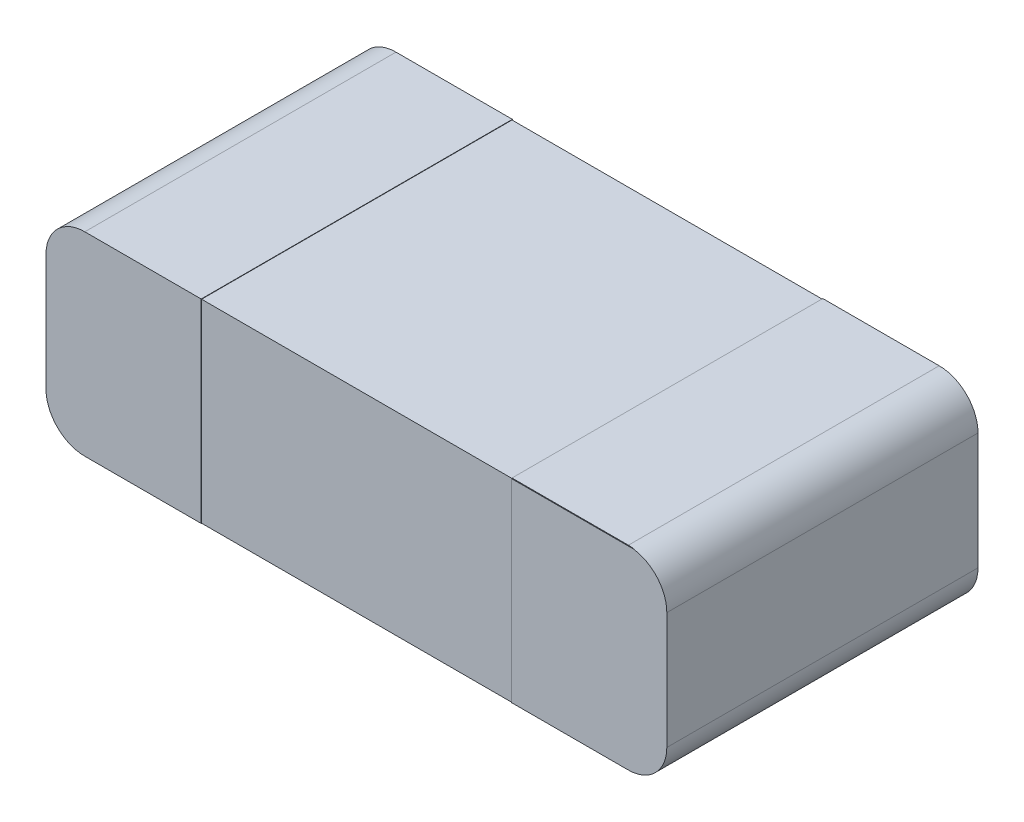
ISO-10303-21;
HEADER;
FILE_DESCRIPTION(('STEP AP214'),'2;1');
FILE_NAME('part.step','',(''),(''),'','','');
FILE_SCHEMA(('AUTOMOTIVE_DESIGN { 1 0 10303 214 1 1 1 1 }'));
ENDSEC;
DATA;
#1=APPLICATION_CONTEXT('core data for automotive mechanical design processes');
#2=APPLICATION_PROTOCOL_DEFINITION('international standard','automotive_design',2000,#1);
#3=PRODUCT_CONTEXT('',#1,'mechanical');
#4=PRODUCT('Part','Part','',(#3));
#5=PRODUCT_RELATED_PRODUCT_CATEGORY('part','',(#4));
#6=PRODUCT_DEFINITION_FORMATION('','',#4);
#7=PRODUCT_DEFINITION_CONTEXT('part definition',#1,'design');
#8=PRODUCT_DEFINITION('design','',#6,#7);
#9=PRODUCT_DEFINITION_SHAPE('','',#8);
#10=(LENGTH_UNIT() NAMED_UNIT(*) SI_UNIT(.MILLI.,.METRE.));
#11=(NAMED_UNIT(*) PLANE_ANGLE_UNIT() SI_UNIT($,.RADIAN.));
#12=(NAMED_UNIT(*) SI_UNIT($,.STERADIAN.) SOLID_ANGLE_UNIT());
#13=UNCERTAINTY_MEASURE_WITH_UNIT(LENGTH_MEASURE(1.E-05),#10,'distance_accuracy_value','');
#14=(GEOMETRIC_REPRESENTATION_CONTEXT(3) GLOBAL_UNCERTAINTY_ASSIGNED_CONTEXT((#13)) GLOBAL_UNIT_ASSIGNED_CONTEXT((#10,
#11,#12)) REPRESENTATION_CONTEXT('',''));
#15=CARTESIAN_POINT('',(0.,0.,0.));
#16=DIRECTION('',(0.,0.,1.));
#17=DIRECTION('',(1.,0.,0.));
#18=AXIS2_PLACEMENT_3D('',#15,#16,#17);
#19=CARTESIAN_POINT('',(0.800000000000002,0.5,0.400999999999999));
#20=DIRECTION('',(0.,-1.,0.));
#21=DIRECTION('',(0.,0.,-1.));
#22=AXIS2_PLACEMENT_3D('',#19,#20,#21);
#23=PLANE('',#22);
#24=DIRECTION('',(0.,0.,-1.));
#25=VECTOR('',#24,1.);
#26=CARTESIAN_POINT('',(0.714106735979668,0.5,0.));
#27=LINE('',#26,#25);
#28=CARTESIAN_POINT('',(0.714106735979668,0.5,0.399999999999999));
#29=VERTEX_POINT('',#28);
#30=CARTESIAN_POINT('',(0.714106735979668,0.5,0.400999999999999));
#31=VERTEX_POINT('',#30);
#32=EDGE_CURVE('E22',#29,#31,#27,.F.);
#33=ORIENTED_EDGE('',*,*,#32,.F.);
#34=DIRECTION('',(-1.,0.,0.));
#35=VECTOR('',#34,1.);
#36=CARTESIAN_POINT('',(-0.799999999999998,0.5,0.399999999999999));
#37=LINE('',#36,#35);
#38=CARTESIAN_POINT('',(0.400000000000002,0.5,0.399999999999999));
#39=VERTEX_POINT('',#38);
#40=EDGE_CURVE('E111',#29,#39,#37,.T.);
#41=ORIENTED_EDGE('',*,*,#40,.T.);
#42=DIRECTION('',(0.,0.,-1.));
#43=VECTOR('',#42,1.);
#44=CARTESIAN_POINT('',(0.400000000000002,0.5,0.400999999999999));
#45=LINE('',#44,#43);
#46=CARTESIAN_POINT('',(0.400000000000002,0.5,0.400999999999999));
#47=VERTEX_POINT('',#46);
#48=EDGE_CURVE('E135',#39,#47,#45,.F.);
#49=ORIENTED_EDGE('',*,*,#48,.T.);
#50=DIRECTION('',(1.,0.,0.));
#51=VECTOR('',#50,1.);
#52=CARTESIAN_POINT('',(0.,0.5,0.400999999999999));
#53=LINE('',#52,#51);
#54=EDGE_CURVE('E113',#31,#47,#53,.F.);
#55=ORIENTED_EDGE('',*,*,#54,.F.);
#56=EDGE_LOOP('',(#33,#41,#49,#55));
#57=FACE_BOUND('',#56,.T.);
#58=ADVANCED_FACE('F19',(#57),#23,.F.);
#59=CARTESIAN_POINT('',(0.700000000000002,0.401,0.));
#60=DIRECTION('',(0.,0.,-1.));
#61=DIRECTION('',(-1.,0.,0.));
#62=AXIS2_PLACEMENT_3D('',#59,#60,#61);
#63=CYLINDRICAL_SURFACE('',#62,0.1);
#64=CARTESIAN_POINT('',(0.700000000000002,0.401,0.399999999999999));
#65=DIRECTION('',(0.,0.,-1.));
#66=DIRECTION('',(-1.,0.,0.));
#67=AXIS2_PLACEMENT_3D('',#64,#65,#66);
#68=CIRCLE('',#67,0.1);
#69=CARTESIAN_POINT('',(0.700000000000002,0.501,0.399999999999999));
#70=VERTEX_POINT('',#69);
#71=EDGE_CURVE('E122',#70,#29,#68,.T.);
#72=ORIENTED_EDGE('',*,*,#71,.T.);
#73=ORIENTED_EDGE('',*,*,#32,.T.);
#74=CARTESIAN_POINT('',(0.700000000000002,0.401,0.400999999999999));
#75=DIRECTION('',(0.,0.,-1.));
#76=DIRECTION('',(-1.,0.,0.));
#77=AXIS2_PLACEMENT_3D('',#74,#75,#76);
#78=CIRCLE('',#77,0.1);
#79=CARTESIAN_POINT('',(0.800000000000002,0.401,0.400999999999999));
#80=VERTEX_POINT('',#79);
#81=EDGE_CURVE('E139',#80,#31,#78,.F.);
#82=ORIENTED_EDGE('',*,*,#81,.F.);
#83=DIRECTION('',(0.,0.,1.));
#84=VECTOR('',#83,1.);
#85=CARTESIAN_POINT('',(0.800000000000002,0.401,-0.400000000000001));
#86=LINE('',#85,#84);
#87=CARTESIAN_POINT('',(0.800000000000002,0.401,-0.401000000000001));
#88=VERTEX_POINT('',#87);
#89=EDGE_CURVE('E118',#80,#88,#86,.F.);
#90=ORIENTED_EDGE('',*,*,#89,.T.);
#91=CARTESIAN_POINT('',(0.700000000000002,0.401,-0.401000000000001));
#92=DIRECTION('',(0.,0.,-1.));
#93=DIRECTION('',(-1.,0.,0.));
#94=AXIS2_PLACEMENT_3D('',#91,#92,#93);
#95=CIRCLE('',#94,0.1);
#96=CARTESIAN_POINT('',(0.700000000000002,0.501,-0.401000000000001));
#97=VERTEX_POINT('',#96);
#98=EDGE_CURVE('E146',#88,#97,#95,.F.);
#99=ORIENTED_EDGE('',*,*,#98,.T.);
#100=DIRECTION('',(0.,0.,-1.));
#101=VECTOR('',#100,1.);
#102=CARTESIAN_POINT('',(0.700000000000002,0.501,0.));
#103=LINE('',#102,#101);
#104=EDGE_CURVE('E131',#97,#70,#103,.F.);
#105=ORIENTED_EDGE('',*,*,#104,.T.);
#106=EDGE_LOOP('',(#72,#73,#82,#90,#99,#105));
#107=FACE_BOUND('',#106,.T.);
#108=ADVANCED_FACE('F129',(#107),#63,.T.);
#109=CARTESIAN_POINT('',(0.800000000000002,0.5,-0.400000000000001));
#110=DIRECTION('',(-1.,0.,0.));
#111=DIRECTION('',(0.,0.,1.));
#112=AXIS2_PLACEMENT_3D('',#109,#110,#111);
#113=PLANE('',#112);
#114=DIRECTION('',(0.,0.,-1.));
#115=VECTOR('',#114,1.);
#116=CARTESIAN_POINT('',(0.800000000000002,0.1,-0.400000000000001));
#117=LINE('',#116,#115);
#118=CARTESIAN_POINT('',(0.800000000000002,0.1,-0.401000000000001));
#119=VERTEX_POINT('',#118);
#120=CARTESIAN_POINT('',(0.800000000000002,0.1,0.400999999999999));
#121=VERTEX_POINT('',#120);
#122=EDGE_CURVE('E144',#119,#121,#117,.F.);
#123=ORIENTED_EDGE('',*,*,#122,.F.);
#124=DIRECTION('',(0.,1.,0.));
#125=VECTOR('',#124,1.);
#126=CARTESIAN_POINT('',(0.800000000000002,0.,-0.401000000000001));
#127=LINE('',#126,#125);
#128=EDGE_CURVE('E152',#119,#88,#127,.T.);
#129=ORIENTED_EDGE('',*,*,#128,.T.);
#130=ORIENTED_EDGE('',*,*,#89,.F.);
#131=DIRECTION('',(0.,1.,0.));
#132=VECTOR('',#131,1.);
#133=CARTESIAN_POINT('',(0.800000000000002,0.,0.400999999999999));
#134=LINE('',#133,#132);
#135=EDGE_CURVE('E141',#121,#80,#134,.T.);
#136=ORIENTED_EDGE('',*,*,#135,.F.);
#137=EDGE_LOOP('',(#123,#129,#130,#136));
#138=FACE_BOUND('',#137,.T.);
#139=ADVANCED_FACE('F540',(#138),#113,.F.);
#140=CARTESIAN_POINT('',(0.,0.501,0.));
#141=DIRECTION('',(0.,-1.,0.));
#142=DIRECTION('',(0.,0.,-1.));
#143=AXIS2_PLACEMENT_3D('',#140,#141,#142);
#144=PLANE('',#143);
#145=ORIENTED_EDGE('',*,*,#104,.F.);
#146=DIRECTION('',(1.,0.,0.));
#147=VECTOR('',#146,1.);
#148=CARTESIAN_POINT('',(0.,0.501,-0.401000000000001));
#149=LINE('',#148,#147);
#150=CARTESIAN_POINT('',(0.400000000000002,0.501,-0.401000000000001));
#151=VERTEX_POINT('',#150);
#152=EDGE_CURVE('E148',#97,#151,#149,.F.);
#153=ORIENTED_EDGE('',*,*,#152,.T.);
#154=DIRECTION('',(0.,0.,-1.));
#155=VECTOR('',#154,1.);
#156=CARTESIAN_POINT('',(0.400000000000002,0.501,-0.400000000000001));
#157=LINE('',#156,#155);
#158=CARTESIAN_POINT('',(0.400000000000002,0.501,0.399999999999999));
#159=VERTEX_POINT('',#158);
#160=EDGE_CURVE('E155',#151,#159,#157,.F.);
#161=ORIENTED_EDGE('',*,*,#160,.T.);
#162=DIRECTION('',(-1.,0.,0.));
#163=VECTOR('',#162,1.);
#164=CARTESIAN_POINT('',(-0.799999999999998,0.501,0.399999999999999));
#165=LINE('',#164,#163);
#166=EDGE_CURVE('E132',#159,#70,#165,.F.);
#167=ORIENTED_EDGE('',*,*,#166,.T.);
#168=EDGE_LOOP('',(#145,#153,#161,#167));
#169=FACE_BOUND('',#168,.T.);
#170=ADVANCED_FACE('F532',(#169),#144,.F.);
#171=CARTESIAN_POINT('',(-0.799999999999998,0.5,0.399999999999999));
#172=DIRECTION('',(0.,0.,-1.));
#173=DIRECTION('',(-1.,0.,0.));
#174=AXIS2_PLACEMENT_3D('',#171,#172,#173);
#175=PLANE('',#174);
#176=ORIENTED_EDGE('',*,*,#71,.F.);
#177=ORIENTED_EDGE('',*,*,#166,.F.);
#178=DIRECTION('',(0.,1.,0.));
#179=VECTOR('',#178,1.);
#180=CARTESIAN_POINT('',(0.400000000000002,0.5,0.399999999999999));
#181=LINE('',#180,#179);
#182=EDGE_CURVE('E125',#159,#39,#181,.F.);
#183=ORIENTED_EDGE('',*,*,#182,.T.);
#184=ORIENTED_EDGE('',*,*,#40,.F.);
#185=EDGE_LOOP('',(#176,#177,#183,#184));
#186=FACE_BOUND('',#185,.T.);
#187=ADVANCED_FACE('F121',(#186),#175,.F.);
#188=CARTESIAN_POINT('',(0.,0.5,0.));
#189=DIRECTION('',(0.,1.,0.));
#190=DIRECTION('',(0.,0.,1.));
#191=AXIS2_PLACEMENT_3D('',#188,#189,#190);
#192=PLANE('',#191);
#193=DIRECTION('',(1.,0.,0.));
#194=VECTOR('',#193,1.);
#195=CARTESIAN_POINT('',(-0.799999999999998,0.5,-0.400000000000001));
#196=LINE('',#195,#194);
#197=CARTESIAN_POINT('',(0.400000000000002,0.5,-0.400000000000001));
#198=VERTEX_POINT('',#197);
#199=CARTESIAN_POINT('',(-0.399999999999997,0.5,-0.400000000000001));
#200=VERTEX_POINT('',#199);
#201=EDGE_CURVE('E206',#198,#200,#196,.F.);
#202=ORIENTED_EDGE('',*,*,#201,.T.);
#203=DIRECTION('',(0.,0.,1.));
#204=VECTOR('',#203,1.);
#205=CARTESIAN_POINT('',(-0.399999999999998,0.5,0.399999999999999));
#206=LINE('',#205,#204);
#207=CARTESIAN_POINT('',(-0.399999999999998,0.5,0.399999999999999));
#208=VERTEX_POINT('',#207);
#209=EDGE_CURVE('E200',#200,#208,#206,.T.);
#210=ORIENTED_EDGE('',*,*,#209,.T.);
#211=DIRECTION('',(-1.,0.,0.));
#212=VECTOR('',#211,1.);
#213=CARTESIAN_POINT('',(-0.799999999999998,0.5,0.399999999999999));
#214=LINE('',#213,#212);
#215=EDGE_CURVE('E138',#208,#39,#214,.F.);
#216=ORIENTED_EDGE('',*,*,#215,.T.);
#217=DIRECTION('',(0.,0.,-1.));
#218=VECTOR('',#217,1.);
#219=CARTESIAN_POINT('',(0.400000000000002,0.5,-0.400000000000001));
#220=LINE('',#219,#218);
#221=EDGE_CURVE('E154',#39,#198,#220,.T.);
#222=ORIENTED_EDGE('',*,*,#221,.T.);
#223=EDGE_LOOP('',(#202,#210,#216,#222));
#224=FACE_BOUND('',#223,.T.);
#225=ADVANCED_FACE('F361',(#224),#192,.T.);
#226=CARTESIAN_POINT('',(-0.699999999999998,0.401,0.));
#227=DIRECTION('',(0.,0.,-1.));
#228=DIRECTION('',(-1.,0.,0.));
#229=AXIS2_PLACEMENT_3D('',#226,#227,#228);
#230=CYLINDRICAL_SURFACE('',#229,0.1);
#231=CARTESIAN_POINT('',(-0.699999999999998,0.401,0.400999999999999));
#232=DIRECTION('',(0.,0.,-1.));
#233=DIRECTION('',(-1.,0.,0.));
#234=AXIS2_PLACEMENT_3D('',#231,#232,#233);
#235=CIRCLE('',#234,0.1);
#236=CARTESIAN_POINT('',(-0.799999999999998,0.401,0.400999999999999));
#237=VERTEX_POINT('',#236);
#238=CARTESIAN_POINT('',(-0.699999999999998,0.501,0.400999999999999));
#239=VERTEX_POINT('',#238);
#240=EDGE_CURVE('E164',#237,#239,#235,.T.);
#241=ORIENTED_EDGE('',*,*,#240,.T.);
#242=DIRECTION('',(0.,0.,1.));
#243=VECTOR('',#242,1.);
#244=CARTESIAN_POINT('',(-0.699999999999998,0.501,0.));
#245=LINE('',#244,#243);
#246=CARTESIAN_POINT('',(-0.699999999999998,0.501,-0.401000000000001));
#247=VERTEX_POINT('',#246);
#248=EDGE_CURVE('E127',#247,#239,#245,.T.);
#249=ORIENTED_EDGE('',*,*,#248,.F.);
#250=CARTESIAN_POINT('',(-0.699999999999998,0.401,-0.401000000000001));
#251=DIRECTION('',(0.,0.,-1.));
#252=DIRECTION('',(-1.,0.,0.));
#253=AXIS2_PLACEMENT_3D('',#250,#251,#252);
#254=CIRCLE('',#253,0.1);
#255=CARTESIAN_POINT('',(-0.799999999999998,0.401,-0.401000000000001));
#256=VERTEX_POINT('',#255);
#257=EDGE_CURVE('E156',#256,#247,#254,.T.);
#258=ORIENTED_EDGE('',*,*,#257,.F.);
#259=DIRECTION('',(0.,0.,-1.));
#260=VECTOR('',#259,1.);
#261=CARTESIAN_POINT('',(-0.799999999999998,0.401,-0.400000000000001));
#262=LINE('',#261,#260);
#263=EDGE_CURVE('E197',#256,#237,#262,.F.);
#264=ORIENTED_EDGE('',*,*,#263,.T.);
#265=EDGE_LOOP('',(#241,#249,#258,#264));
#266=FACE_BOUND('',#265,.T.);
#267=ADVANCED_FACE('F349',(#266),#230,.T.);
#268=CARTESIAN_POINT('',(0.,0.501,0.));
#269=DIRECTION('',(0.,1.,0.));
#270=DIRECTION('',(0.,0.,1.));
#271=AXIS2_PLACEMENT_3D('',#268,#269,#270);
#272=PLANE('',#271);
#273=DIRECTION('',(-1.,0.,0.));
#274=VECTOR('',#273,1.);
#275=CARTESIAN_POINT('',(0.,0.501,0.400999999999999));
#276=LINE('',#275,#274);
#277=CARTESIAN_POINT('',(-0.399999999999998,0.501,0.400999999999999));
#278=VERTEX_POINT('',#277);
#279=EDGE_CURVE('E167',#239,#278,#276,.F.);
#280=ORIENTED_EDGE('',*,*,#279,.T.);
#281=DIRECTION('',(0.,0.,1.));
#282=VECTOR('',#281,1.);
#283=CARTESIAN_POINT('',(-0.399999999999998,0.501,0.399999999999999));
#284=LINE('',#283,#282);
#285=CARTESIAN_POINT('',(-0.399999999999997,0.501,-0.401000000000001));
#286=VERTEX_POINT('',#285);
#287=EDGE_CURVE('E214',#278,#286,#284,.F.);
#288=ORIENTED_EDGE('',*,*,#287,.T.);
#289=DIRECTION('',(-1.,0.,0.));
#290=VECTOR('',#289,1.);
#291=CARTESIAN_POINT('',(0.,0.501,-0.401000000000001));
#292=LINE('',#291,#290);
#293=EDGE_CURVE('E158',#247,#286,#292,.F.);
#294=ORIENTED_EDGE('',*,*,#293,.F.);
#295=ORIENTED_EDGE('',*,*,#248,.T.);
#296=EDGE_LOOP('',(#280,#288,#294,#295));
#297=FACE_BOUND('',#296,.T.);
#298=ADVANCED_FACE('F352',(#297),#272,.T.);
#299=CARTESIAN_POINT('',(-0.799999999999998,0.5,-0.400000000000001));
#300=DIRECTION('',(1.,0.,0.));
#301=DIRECTION('',(0.,0.,-1.));
#302=AXIS2_PLACEMENT_3D('',#299,#300,#301);
#303=PLANE('',#302);
#304=DIRECTION('',(0.,0.,1.));
#305=VECTOR('',#304,1.);
#306=CARTESIAN_POINT('',(-0.799999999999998,0.1,-0.400000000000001));
#307=LINE('',#306,#305);
#308=CARTESIAN_POINT('',(-0.799999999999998,0.1,0.400999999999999));
#309=VERTEX_POINT('',#308);
#310=CARTESIAN_POINT('',(-0.799999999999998,0.1,-0.401000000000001));
#311=VERTEX_POINT('',#310);
#312=EDGE_CURVE('E162',#309,#311,#307,.F.);
#313=ORIENTED_EDGE('',*,*,#312,.F.);
#314=DIRECTION('',(0.,1.,0.));
#315=VECTOR('',#314,1.);
#316=CARTESIAN_POINT('',(-0.799999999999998,0.,0.400999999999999));
#317=LINE('',#316,#315);
#318=EDGE_CURVE('E169',#309,#237,#317,.T.);
#319=ORIENTED_EDGE('',*,*,#318,.T.);
#320=ORIENTED_EDGE('',*,*,#263,.F.);
#321=DIRECTION('',(0.,1.,0.));
#322=VECTOR('',#321,1.);
#323=CARTESIAN_POINT('',(-0.799999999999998,0.,-0.401000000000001));
#324=LINE('',#323,#322);
#325=EDGE_CURVE('E159',#311,#256,#324,.T.);
#326=ORIENTED_EDGE('',*,*,#325,.F.);
#327=EDGE_LOOP('',(#313,#319,#320,#326));
#328=FACE_BOUND('',#327,.T.);
#329=ADVANCED_FACE('F345',(#328),#303,.F.);
#330=CARTESIAN_POINT('',(-0.799999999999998,0.5,0.399999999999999));
#331=DIRECTION('',(0.,0.,-1.));
#332=DIRECTION('',(-1.,0.,0.));
#333=AXIS2_PLACEMENT_3D('',#330,#331,#332);
#334=PLANE('',#333);
#335=ORIENTED_EDGE('',*,*,#215,.F.);
#336=DIRECTION('',(0.,1.,0.));
#337=VECTOR('',#336,1.);
#338=CARTESIAN_POINT('',(-0.399999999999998,0.501,0.399999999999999));
#339=LINE('',#338,#337);
#340=CARTESIAN_POINT('',(-0.399999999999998,0.,0.399999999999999));
#341=VERTEX_POINT('',#340);
#342=EDGE_CURVE('E209',#208,#341,#339,.F.);
#343=ORIENTED_EDGE('',*,*,#342,.T.);
#344=DIRECTION('',(1.,0.,0.));
#345=VECTOR('',#344,1.);
#346=CARTESIAN_POINT('',(0.,0.,0.399999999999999));
#347=LINE('',#346,#345);
#348=CARTESIAN_POINT('',(0.400000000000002,0.,0.399999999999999));
#349=VERTEX_POINT('',#348);
#350=EDGE_CURVE('E174',#341,#349,#347,.T.);
#351=ORIENTED_EDGE('',*,*,#350,.T.);
#352=DIRECTION('',(0.,1.,0.));
#353=VECTOR('',#352,1.);
#354=CARTESIAN_POINT('',(0.400000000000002,0.,0.399999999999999));
#355=LINE('',#354,#353);
#356=EDGE_CURVE('E137',#349,#39,#355,.T.);
#357=ORIENTED_EDGE('',*,*,#356,.T.);
#358=EDGE_LOOP('',(#335,#343,#351,#357));
#359=FACE_BOUND('',#358,.T.);
#360=ADVANCED_FACE('F336',(#359),#334,.F.);
#361=CARTESIAN_POINT('',(0.400000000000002,0.,0.400999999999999));
#362=DIRECTION('',(1.,0.,0.));
#363=DIRECTION('',(0.,0.,-1.));
#364=AXIS2_PLACEMENT_3D('',#361,#362,#363);
#365=PLANE('',#364);
#366=DIRECTION('',(0.,0.,-1.));
#367=VECTOR('',#366,1.);
#368=CARTESIAN_POINT('',(0.400000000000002,0.,0.400999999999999));
#369=LINE('',#368,#367);
#370=CARTESIAN_POINT('',(0.400000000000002,0.,0.400999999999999));
#371=VERTEX_POINT('',#370);
#372=EDGE_CURVE('E175',#349,#371,#369,.F.);
#373=ORIENTED_EDGE('',*,*,#372,.T.);
#374=DIRECTION('',(0.,1.,0.));
#375=VECTOR('',#374,1.);
#376=CARTESIAN_POINT('',(0.400000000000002,0.,0.400999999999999));
#377=LINE('',#376,#375);
#378=EDGE_CURVE('E145',#47,#371,#377,.F.);
#379=ORIENTED_EDGE('',*,*,#378,.F.);
#380=ORIENTED_EDGE('',*,*,#48,.F.);
#381=ORIENTED_EDGE('',*,*,#356,.F.);
#382=EDGE_LOOP('',(#373,#379,#380,#381));
#383=FACE_BOUND('',#382,.T.);
#384=ADVANCED_FACE('F393',(#383),#365,.F.);
#385=CARTESIAN_POINT('',(0.,0.,0.400999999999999));
#386=DIRECTION('',(0.,0.,1.));
#387=DIRECTION('',(1.,0.,0.));
#388=AXIS2_PLACEMENT_3D('',#385,#386,#387);
#389=PLANE('',#388);
#390=ORIENTED_EDGE('',*,*,#54,.T.);
#391=ORIENTED_EDGE('',*,*,#378,.T.);
#392=DIRECTION('',(1.,0.,0.));
#393=VECTOR('',#392,1.);
#394=CARTESIAN_POINT('',(0.,0.,0.400999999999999));
#395=LINE('',#394,#393);
#396=CARTESIAN_POINT('',(0.700000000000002,0.,0.400999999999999));
#397=VERTEX_POINT('',#396);
#398=EDGE_CURVE('E178',#371,#397,#395,.T.);
#399=ORIENTED_EDGE('',*,*,#398,.T.);
#400=CARTESIAN_POINT('',(0.700000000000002,0.1,0.400999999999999));
#401=DIRECTION('',(0.,0.,-1.));
#402=DIRECTION('',(-1.,0.,0.));
#403=AXIS2_PLACEMENT_3D('',#400,#401,#402);
#404=CIRCLE('',#403,0.1);
#405=EDGE_CURVE('E142',#121,#397,#404,.T.);
#406=ORIENTED_EDGE('',*,*,#405,.F.);
#407=ORIENTED_EDGE('',*,*,#135,.T.);
#408=ORIENTED_EDGE('',*,*,#81,.T.);
#409=EDGE_LOOP('',(#390,#391,#399,#406,#407,#408));
#410=FACE_BOUND('',#409,.T.);
#411=ADVANCED_FACE('F389',(#410),#389,.T.);
#412=CARTESIAN_POINT('',(0.700000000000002,0.1,-0.400000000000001));
#413=DIRECTION('',(0.,0.,-1.));
#414=DIRECTION('',(-1.,0.,0.));
#415=AXIS2_PLACEMENT_3D('',#412,#413,#414);
#416=CYLINDRICAL_SURFACE('',#415,0.1);
#417=CARTESIAN_POINT('',(0.700000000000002,0.1,-0.401000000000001));
#418=DIRECTION('',(0.,0.,-1.));
#419=DIRECTION('',(-1.,0.,0.));
#420=AXIS2_PLACEMENT_3D('',#417,#418,#419);
#421=CIRCLE('',#420,0.1);
#422=CARTESIAN_POINT('',(0.700000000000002,0.,-0.401000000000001));
#423=VERTEX_POINT('',#422);
#424=EDGE_CURVE('E149',#423,#119,#421,.F.);
#425=ORIENTED_EDGE('',*,*,#424,.T.);
#426=ORIENTED_EDGE('',*,*,#122,.T.);
#427=ORIENTED_EDGE('',*,*,#405,.T.);
#428=DIRECTION('',(0.,0.,1.));
#429=VECTOR('',#428,1.);
#430=CARTESIAN_POINT('',(0.700000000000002,0.,0.));
#431=LINE('',#430,#429);
#432=EDGE_CURVE('E228',#397,#423,#431,.F.);
#433=ORIENTED_EDGE('',*,*,#432,.T.);
#434=EDGE_LOOP('',(#425,#426,#427,#433));
#435=FACE_BOUND('',#434,.T.);
#436=ADVANCED_FACE('F385',(#435),#416,.T.);
#437=CARTESIAN_POINT('',(0.,0.,-0.401000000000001));
#438=DIRECTION('',(0.,0.,1.));
#439=DIRECTION('',(1.,0.,0.));
#440=AXIS2_PLACEMENT_3D('',#437,#438,#439);
#441=PLANE('',#440);
#442=ORIENTED_EDGE('',*,*,#424,.F.);
#443=DIRECTION('',(1.,0.,0.));
#444=VECTOR('',#443,1.);
#445=CARTESIAN_POINT('',(0.,0.,-0.401000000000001));
#446=LINE('',#445,#444);
#447=CARTESIAN_POINT('',(0.400000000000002,0.,-0.401000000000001));
#448=VERTEX_POINT('',#447);
#449=EDGE_CURVE('E183',#423,#448,#446,.F.);
#450=ORIENTED_EDGE('',*,*,#449,.T.);
#451=DIRECTION('',(0.,1.,0.));
#452=VECTOR('',#451,1.);
#453=CARTESIAN_POINT('',(0.400000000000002,0.501,-0.401000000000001));
#454=LINE('',#453,#452);
#455=EDGE_CURVE('E237',#448,#151,#454,.T.);
#456=ORIENTED_EDGE('',*,*,#455,.T.);
#457=ORIENTED_EDGE('',*,*,#152,.F.);
#458=ORIENTED_EDGE('',*,*,#98,.F.);
#459=ORIENTED_EDGE('',*,*,#128,.F.);
#460=EDGE_LOOP('',(#442,#450,#456,#457,#458,#459));
#461=FACE_BOUND('',#460,.T.);
#462=ADVANCED_FACE('F381',(#461),#441,.F.);
#463=CARTESIAN_POINT('',(0.400000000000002,0.501,-0.400000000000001));
#464=DIRECTION('',(1.,0.,0.));
#465=DIRECTION('',(0.,0.,-1.));
#466=AXIS2_PLACEMENT_3D('',#463,#464,#465);
#467=PLANE('',#466);
#468=ORIENTED_EDGE('',*,*,#182,.F.);
#469=ORIENTED_EDGE('',*,*,#160,.F.);
#470=ORIENTED_EDGE('',*,*,#455,.F.);
#471=DIRECTION('',(0.,0.,-1.));
#472=VECTOR('',#471,1.);
#473=CARTESIAN_POINT('',(0.400000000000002,0.,-0.400000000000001));
#474=LINE('',#473,#472);
#475=CARTESIAN_POINT('',(0.400000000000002,0.,-0.400000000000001));
#476=VERTEX_POINT('',#475);
#477=EDGE_CURVE('E179',#448,#476,#474,.F.);
#478=ORIENTED_EDGE('',*,*,#477,.T.);
#479=DIRECTION('',(0.,1.,0.));
#480=VECTOR('',#479,1.);
#481=CARTESIAN_POINT('',(0.400000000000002,0.5,-0.400000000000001));
#482=LINE('',#481,#480);
#483=EDGE_CURVE('E210',#476,#198,#482,.T.);
#484=ORIENTED_EDGE('',*,*,#483,.T.);
#485=ORIENTED_EDGE('',*,*,#221,.F.);
#486=EDGE_LOOP('',(#468,#469,#470,#478,#484,#485));
#487=FACE_BOUND('',#486,.T.);
#488=ADVANCED_FACE('F378',(#487),#467,.F.);
#489=CARTESIAN_POINT('',(-0.799999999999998,0.5,-0.400000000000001));
#490=DIRECTION('',(0.,0.,1.));
#491=DIRECTION('',(1.,0.,0.));
#492=AXIS2_PLACEMENT_3D('',#489,#490,#491);
#493=PLANE('',#492);
#494=ORIENTED_EDGE('',*,*,#201,.F.);
#495=ORIENTED_EDGE('',*,*,#483,.F.);
#496=DIRECTION('',(1.,0.,0.));
#497=VECTOR('',#496,1.);
#498=CARTESIAN_POINT('',(0.,0.,-0.400000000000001));
#499=LINE('',#498,#497);
#500=CARTESIAN_POINT('',(-0.399999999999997,0.,-0.400000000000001));
#501=VERTEX_POINT('',#500);
#502=EDGE_CURVE('E182',#476,#501,#499,.F.);
#503=ORIENTED_EDGE('',*,*,#502,.T.);
#504=DIRECTION('',(0.,1.,0.));
#505=VECTOR('',#504,1.);
#506=CARTESIAN_POINT('',(-0.399999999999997,0.501,-0.400000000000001));
#507=LINE('',#506,#505);
#508=EDGE_CURVE('E203',#501,#200,#507,.T.);
#509=ORIENTED_EDGE('',*,*,#508,.T.);
#510=EDGE_LOOP('',(#494,#495,#503,#509));
#511=FACE_BOUND('',#510,.T.);
#512=ADVANCED_FACE('F315',(#511),#493,.F.);
#513=CARTESIAN_POINT('',(-0.399999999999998,0.501,0.399999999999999));
#514=DIRECTION('',(-1.,0.,0.));
#515=DIRECTION('',(0.,0.,1.));
#516=AXIS2_PLACEMENT_3D('',#513,#514,#515);
#517=PLANE('',#516);
#518=ORIENTED_EDGE('',*,*,#508,.F.);
#519=DIRECTION('',(0.,0.,1.));
#520=VECTOR('',#519,1.);
#521=CARTESIAN_POINT('',(-0.399999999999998,0.,0.399999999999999));
#522=LINE('',#521,#520);
#523=CARTESIAN_POINT('',(-0.399999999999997,0.,-0.401000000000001));
#524=VERTEX_POINT('',#523);
#525=EDGE_CURVE('E184',#501,#524,#522,.F.);
#526=ORIENTED_EDGE('',*,*,#525,.T.);
#527=DIRECTION('',(0.,1.,0.));
#528=VECTOR('',#527,1.);
#529=CARTESIAN_POINT('',(-0.399999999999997,0.,-0.401000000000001));
#530=LINE('',#529,#528);
#531=EDGE_CURVE('E163',#286,#524,#530,.F.);
#532=ORIENTED_EDGE('',*,*,#531,.F.);
#533=ORIENTED_EDGE('',*,*,#287,.F.);
#534=DIRECTION('',(0.,1.,0.));
#535=VECTOR('',#534,1.);
#536=CARTESIAN_POINT('',(-0.399999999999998,0.,0.400999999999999));
#537=LINE('',#536,#535);
#538=CARTESIAN_POINT('',(-0.399999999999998,0.,0.400999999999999));
#539=VERTEX_POINT('',#538);
#540=EDGE_CURVE('E170',#278,#539,#537,.F.);
#541=ORIENTED_EDGE('',*,*,#540,.T.);
#542=DIRECTION('',(0.,0.,1.));
#543=VECTOR('',#542,1.);
#544=CARTESIAN_POINT('',(-0.399999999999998,0.,0.399999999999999));
#545=LINE('',#544,#543);
#546=EDGE_CURVE('E171',#539,#341,#545,.F.);
#547=ORIENTED_EDGE('',*,*,#546,.T.);
#548=ORIENTED_EDGE('',*,*,#342,.F.);
#549=ORIENTED_EDGE('',*,*,#209,.F.);
#550=EDGE_LOOP('',(#518,#526,#532,#533,#541,#547,#548,#549));
#551=FACE_BOUND('',#550,.T.);
#552=ADVANCED_FACE('F307',(#551),#517,.F.);
#553=CARTESIAN_POINT('',(0.,0.,-0.401000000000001));
#554=DIRECTION('',(0.,0.,-1.));
#555=DIRECTION('',(-1.,0.,0.));
#556=AXIS2_PLACEMENT_3D('',#553,#554,#555);
#557=PLANE('',#556);
#558=ORIENTED_EDGE('',*,*,#293,.T.);
#559=ORIENTED_EDGE('',*,*,#531,.T.);
#560=DIRECTION('',(1.,0.,0.));
#561=VECTOR('',#560,1.);
#562=CARTESIAN_POINT('',(0.,0.,-0.401000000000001));
#563=LINE('',#562,#561);
#564=CARTESIAN_POINT('',(-0.699999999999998,0.,-0.401000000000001));
#565=VERTEX_POINT('',#564);
#566=EDGE_CURVE('E187',#524,#565,#563,.F.);
#567=ORIENTED_EDGE('',*,*,#566,.T.);
#568=CARTESIAN_POINT('',(-0.699999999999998,0.1,-0.401000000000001));
#569=DIRECTION('',(0.,0.,1.));
#570=DIRECTION('',(1.,0.,0.));
#571=AXIS2_PLACEMENT_3D('',#568,#569,#570);
#572=CIRCLE('',#571,0.1);
#573=EDGE_CURVE('E160',#311,#565,#572,.T.);
#574=ORIENTED_EDGE('',*,*,#573,.F.);
#575=ORIENTED_EDGE('',*,*,#325,.T.);
#576=ORIENTED_EDGE('',*,*,#257,.T.);
#577=EDGE_LOOP('',(#558,#559,#567,#574,#575,#576));
#578=FACE_BOUND('',#577,.T.);
#579=ADVANCED_FACE('F296',(#578),#557,.T.);
#580=CARTESIAN_POINT('',(-0.699999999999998,0.1,-0.400000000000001));
#581=DIRECTION('',(0.,0.,1.));
#582=DIRECTION('',(1.,0.,0.));
#583=AXIS2_PLACEMENT_3D('',#580,#581,#582);
#584=CYLINDRICAL_SURFACE('',#583,0.1);
#585=CARTESIAN_POINT('',(-0.699999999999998,0.1,0.400999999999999));
#586=DIRECTION('',(0.,0.,1.));
#587=DIRECTION('',(1.,0.,0.));
#588=AXIS2_PLACEMENT_3D('',#585,#586,#587);
#589=CIRCLE('',#588,0.1);
#590=CARTESIAN_POINT('',(-0.699999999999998,0.,0.400999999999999));
#591=VERTEX_POINT('',#590);
#592=EDGE_CURVE('E36',#591,#309,#589,.F.);
#593=ORIENTED_EDGE('',*,*,#592,.T.);
#594=ORIENTED_EDGE('',*,*,#312,.T.);
#595=ORIENTED_EDGE('',*,*,#573,.T.);
#596=DIRECTION('',(0.,0.,1.));
#597=VECTOR('',#596,1.);
#598=CARTESIAN_POINT('',(-0.699999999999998,0.,0.));
#599=LINE('',#598,#597);
#600=EDGE_CURVE('E28',#565,#591,#599,.T.);
#601=ORIENTED_EDGE('',*,*,#600,.T.);
#602=EDGE_LOOP('',(#593,#594,#595,#601));
#603=FACE_BOUND('',#602,.T.);
#604=ADVANCED_FACE('F343',(#603),#584,.T.);
#605=CARTESIAN_POINT('',(0.,0.,0.400999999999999));
#606=DIRECTION('',(0.,0.,-1.));
#607=DIRECTION('',(-1.,0.,0.));
#608=AXIS2_PLACEMENT_3D('',#605,#606,#607);
#609=PLANE('',#608);
#610=ORIENTED_EDGE('',*,*,#592,.F.);
#611=DIRECTION('',(1.,0.,0.));
#612=VECTOR('',#611,1.);
#613=CARTESIAN_POINT('',(0.,0.,0.400999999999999));
#614=LINE('',#613,#612);
#615=EDGE_CURVE('E11',#591,#539,#614,.T.);
#616=ORIENTED_EDGE('',*,*,#615,.T.);
#617=ORIENTED_EDGE('',*,*,#540,.F.);
#618=ORIENTED_EDGE('',*,*,#279,.F.);
#619=ORIENTED_EDGE('',*,*,#240,.F.);
#620=ORIENTED_EDGE('',*,*,#318,.F.);
#621=EDGE_LOOP('',(#610,#616,#617,#618,#619,#620));
#622=FACE_BOUND('',#621,.T.);
#623=ADVANCED_FACE('F341',(#622),#609,.F.);
#624=CARTESIAN_POINT('',(0.,0.,0.));
#625=DIRECTION('',(0.,1.,0.));
#626=DIRECTION('',(0.,0.,1.));
#627=AXIS2_PLACEMENT_3D('',#624,#625,#626);
#628=PLANE('',#627);
#629=ORIENTED_EDGE('',*,*,#600,.F.);
#630=ORIENTED_EDGE('',*,*,#566,.F.);
#631=ORIENTED_EDGE('',*,*,#525,.F.);
#632=ORIENTED_EDGE('',*,*,#502,.F.);
#633=ORIENTED_EDGE('',*,*,#477,.F.);
#634=ORIENTED_EDGE('',*,*,#449,.F.);
#635=ORIENTED_EDGE('',*,*,#432,.F.);
#636=ORIENTED_EDGE('',*,*,#398,.F.);
#637=ORIENTED_EDGE('',*,*,#372,.F.);
#638=ORIENTED_EDGE('',*,*,#350,.F.);
#639=ORIENTED_EDGE('',*,*,#546,.F.);
#640=ORIENTED_EDGE('',*,*,#615,.F.);
#641=EDGE_LOOP('',(#629,#630,#631,#632,#633,#634,#635,#636,#637,#638,#639,#640));
#642=FACE_BOUND('',#641,.T.);
#643=ADVANCED_FACE('F301',(#642),#628,.F.);
#644=CLOSED_SHELL('',(#58,#108,#139,#170,#187,#225,#267,#298,#329,#360,#384,#411,#436,#462,#488,
#512,#552,#579,#604,#623,#643));
#645=MANIFOLD_SOLID_BREP('B1',#644);
#646=ADVANCED_BREP_SHAPE_REPRESENTATION('',(#18,#645),#14);
#647=SHAPE_DEFINITION_REPRESENTATION(#9,#646);
ENDSEC;
END-ISO-10303-21;
